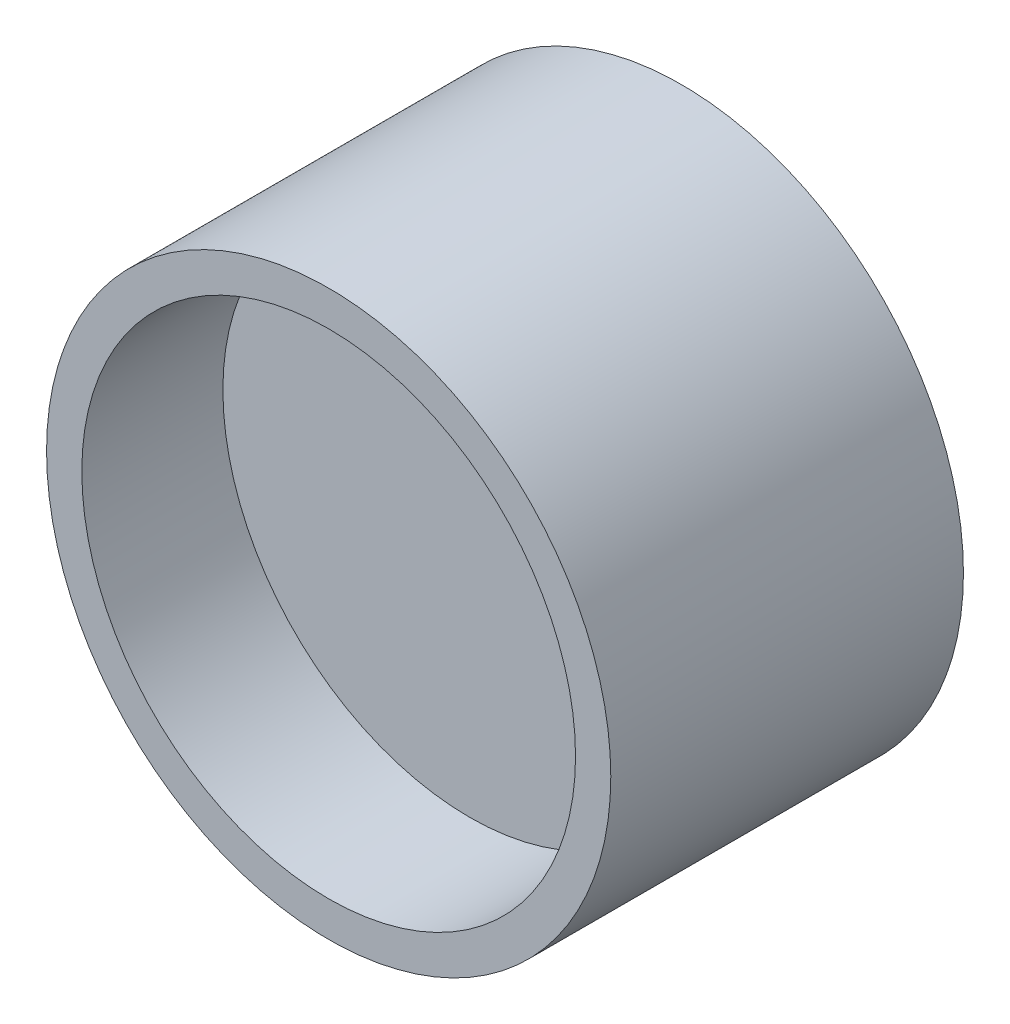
ISO-10303-21;
HEADER;
FILE_DESCRIPTION(('STEP AP214'),'2;1');
FILE_NAME('part.step','',(''),(''),'','','');
FILE_SCHEMA(('AUTOMOTIVE_DESIGN { 1 0 10303 214 1 1 1 1 }'));
ENDSEC;
DATA;
#1=APPLICATION_CONTEXT('core data for automotive mechanical design processes');
#2=APPLICATION_PROTOCOL_DEFINITION('international standard','automotive_design',2000,#1);
#3=PRODUCT_CONTEXT('',#1,'mechanical');
#4=PRODUCT('Part','Part','',(#3));
#5=PRODUCT_RELATED_PRODUCT_CATEGORY('part','',(#4));
#6=PRODUCT_DEFINITION_FORMATION('','',#4);
#7=PRODUCT_DEFINITION_CONTEXT('part definition',#1,'design');
#8=PRODUCT_DEFINITION('design','',#6,#7);
#9=PRODUCT_DEFINITION_SHAPE('','',#8);
#10=(LENGTH_UNIT() NAMED_UNIT(*) SI_UNIT(.MILLI.,.METRE.));
#11=(NAMED_UNIT(*) PLANE_ANGLE_UNIT() SI_UNIT($,.RADIAN.));
#12=(NAMED_UNIT(*) SI_UNIT($,.STERADIAN.) SOLID_ANGLE_UNIT());
#13=UNCERTAINTY_MEASURE_WITH_UNIT(LENGTH_MEASURE(1.E-05),#10,'distance_accuracy_value','');
#14=(GEOMETRIC_REPRESENTATION_CONTEXT(3) GLOBAL_UNCERTAINTY_ASSIGNED_CONTEXT((#13)) GLOBAL_UNIT_ASSIGNED_CONTEXT((#10,
#11,#12)) REPRESENTATION_CONTEXT('',''));
#15=CARTESIAN_POINT('',(0.,0.,0.));
#16=DIRECTION('',(0.,0.,1.));
#17=DIRECTION('',(1.,0.,0.));
#18=AXIS2_PLACEMENT_3D('',#15,#16,#17);
#19=CARTESIAN_POINT('',(0.,0.,50.));
#20=DIRECTION('',(0.,0.,-1.));
#21=DIRECTION('',(-1.,0.,0.));
#22=AXIS2_PLACEMENT_3D('',#19,#20,#21);
#23=CYLINDRICAL_SURFACE('',#22,40.);
#24=CARTESIAN_POINT('',(0.,0.,50.));
#25=DIRECTION('',(0.,0.,1.));
#26=DIRECTION('',(1.,0.,0.));
#27=AXIS2_PLACEMENT_3D('',#24,#25,#26);
#28=CIRCLE('',#27,40.);
#29=CARTESIAN_POINT('',(40.,0.,50.));
#30=VERTEX_POINT('',#29);
#31=EDGE_CURVE('E10',#30,#30,#28,.T.);
#32=ORIENTED_EDGE('',*,*,#31,.F.);
#33=EDGE_LOOP('',(#32));
#34=FACE_BOUND('',#33,.T.);
#35=CARTESIAN_POINT('',(0.,0.,0.));
#36=DIRECTION('',(0.,0.,1.));
#37=DIRECTION('',(1.,0.,0.));
#38=AXIS2_PLACEMENT_3D('',#35,#36,#37);
#39=CIRCLE('',#38,40.);
#40=CARTESIAN_POINT('',(40.,0.,0.));
#41=VERTEX_POINT('',#40);
#42=EDGE_CURVE('E33',#41,#41,#39,.T.);
#43=ORIENTED_EDGE('',*,*,#42,.T.);
#44=EDGE_LOOP('',(#43));
#45=FACE_BOUND('',#44,.T.);
#46=ADVANCED_FACE('F30',(#34,#45),#23,.T.);
#47=CARTESIAN_POINT('',(0.,0.,50.));
#48=DIRECTION('',(0.,0.,1.));
#49=DIRECTION('',(1.,0.,0.));
#50=AXIS2_PLACEMENT_3D('',#47,#48,#49);
#51=PLANE('',#50);
#52=CARTESIAN_POINT('',(0.,0.,50.));
#53=DIRECTION('',(0.,0.,1.));
#54=DIRECTION('',(1.,0.,0.));
#55=AXIS2_PLACEMENT_3D('',#52,#53,#54);
#56=CIRCLE('',#55,35.);
#57=CARTESIAN_POINT('',(35.,0.,50.));
#58=VERTEX_POINT('',#57);
#59=EDGE_CURVE('E42',#58,#58,#56,.T.);
#60=ORIENTED_EDGE('',*,*,#59,.F.);
#61=EDGE_LOOP('',(#60));
#62=FACE_BOUND('',#61,.T.);
#63=ORIENTED_EDGE('',*,*,#31,.T.);
#64=EDGE_LOOP('',(#63));
#65=FACE_BOUND('',#64,.T.);
#66=ADVANCED_FACE('F57',(#62,#65),#51,.T.);
#67=CARTESIAN_POINT('',(0.,0.,0.));
#68=DIRECTION('',(0.,0.,1.));
#69=DIRECTION('',(1.,0.,0.));
#70=AXIS2_PLACEMENT_3D('',#67,#68,#69);
#71=PLANE('',#70);
#72=ORIENTED_EDGE('',*,*,#42,.F.);
#73=EDGE_LOOP('',(#72));
#74=FACE_BOUND('',#73,.T.);
#75=ADVANCED_FACE('F53',(#74),#71,.F.);
#76=CARTESIAN_POINT('',(0.,0.,30.));
#77=DIRECTION('',(0.,0.,1.));
#78=DIRECTION('',(1.,0.,0.));
#79=AXIS2_PLACEMENT_3D('',#76,#77,#78);
#80=CYLINDRICAL_SURFACE('',#79,35.);
#81=CARTESIAN_POINT('',(0.,0.,30.));
#82=DIRECTION('',(0.,0.,1.));
#83=DIRECTION('',(1.,0.,0.));
#84=AXIS2_PLACEMENT_3D('',#81,#82,#83);
#85=CIRCLE('',#84,35.);
#86=CARTESIAN_POINT('',(35.,0.,30.));
#87=VERTEX_POINT('',#86);
#88=EDGE_CURVE('E40',#87,#87,#85,.T.);
#89=ORIENTED_EDGE('',*,*,#88,.F.);
#90=EDGE_LOOP('',(#89));
#91=FACE_BOUND('',#90,.T.);
#92=ORIENTED_EDGE('',*,*,#59,.T.);
#93=EDGE_LOOP('',(#92));
#94=FACE_BOUND('',#93,.T.);
#95=ADVANCED_FACE('F50',(#91,#94),#80,.F.);
#96=CARTESIAN_POINT('',(0.,0.,30.));
#97=DIRECTION('',(0.,0.,1.));
#98=DIRECTION('',(1.,0.,0.));
#99=AXIS2_PLACEMENT_3D('',#96,#97,#98);
#100=PLANE('',#99);
#101=ORIENTED_EDGE('',*,*,#88,.T.);
#102=EDGE_LOOP('',(#101));
#103=FACE_BOUND('',#102,.T.);
#104=ADVANCED_FACE('F48',(#103),#100,.T.);
#105=CLOSED_SHELL('',(#46,#66,#75,#95,#104));
#106=MANIFOLD_SOLID_BREP('B2',#105);
#107=ADVANCED_BREP_SHAPE_REPRESENTATION('',(#18,#106),#14);
#108=SHAPE_DEFINITION_REPRESENTATION(#9,#107);
ENDSEC;
END-ISO-10303-21;
